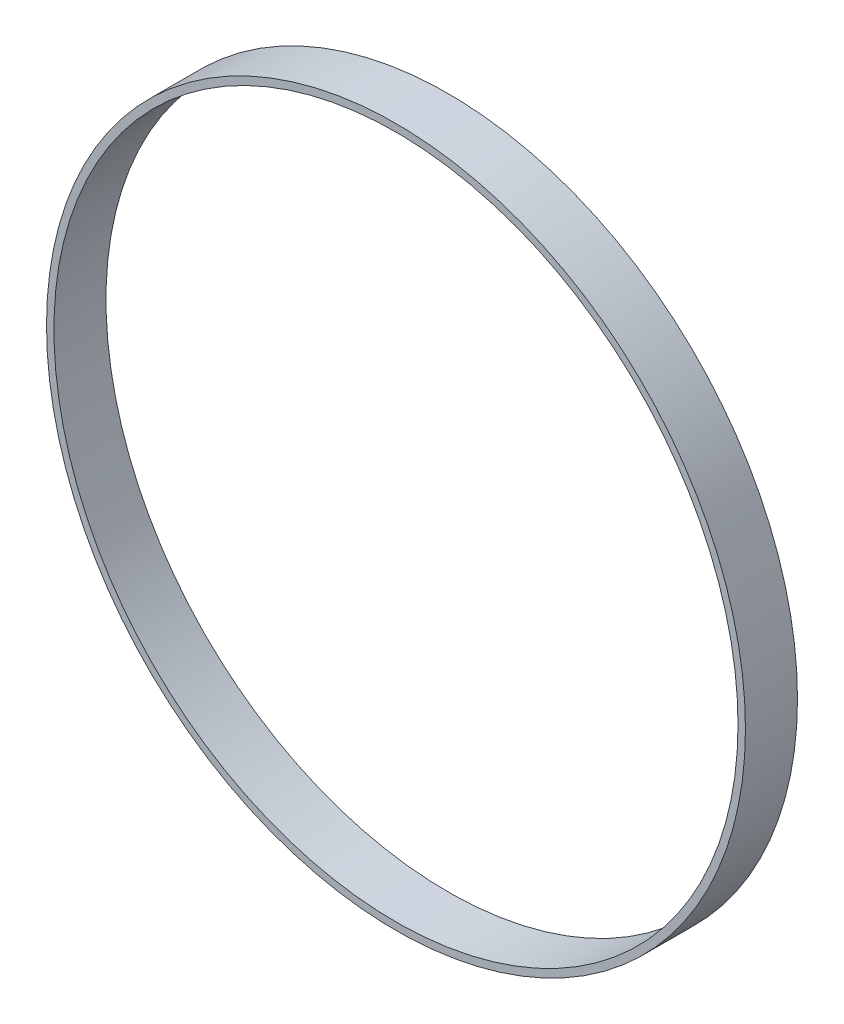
ISO-10303-21;
HEADER;
FILE_DESCRIPTION(('STEP AP214'),'2;1');
FILE_NAME('part.step','',(''),(''),'','','');
FILE_SCHEMA(('AUTOMOTIVE_DESIGN { 1 0 10303 214 1 1 1 1 }'));
ENDSEC;
DATA;
#1=APPLICATION_CONTEXT('core data for automotive mechanical design processes');
#2=APPLICATION_PROTOCOL_DEFINITION('international standard','automotive_design',2000,#1);
#3=PRODUCT_CONTEXT('',#1,'mechanical');
#4=PRODUCT('Part','Part','',(#3));
#5=PRODUCT_RELATED_PRODUCT_CATEGORY('part','',(#4));
#6=PRODUCT_DEFINITION_FORMATION('','',#4);
#7=PRODUCT_DEFINITION_CONTEXT('part definition',#1,'design');
#8=PRODUCT_DEFINITION('design','',#6,#7);
#9=PRODUCT_DEFINITION_SHAPE('','',#8);
#10=(LENGTH_UNIT() NAMED_UNIT(*) SI_UNIT(.MILLI.,.METRE.));
#11=(NAMED_UNIT(*) PLANE_ANGLE_UNIT() SI_UNIT($,.RADIAN.));
#12=(NAMED_UNIT(*) SI_UNIT($,.STERADIAN.) SOLID_ANGLE_UNIT());
#13=UNCERTAINTY_MEASURE_WITH_UNIT(LENGTH_MEASURE(1.E-05),#10,'distance_accuracy_value','');
#14=(GEOMETRIC_REPRESENTATION_CONTEXT(3) GLOBAL_UNCERTAINTY_ASSIGNED_CONTEXT((#13)) GLOBAL_UNIT_ASSIGNED_CONTEXT((#10,
#11,#12)) REPRESENTATION_CONTEXT('',''));
#15=CARTESIAN_POINT('',(0.,0.,0.));
#16=DIRECTION('',(0.,0.,1.));
#17=DIRECTION('',(1.,0.,0.));
#18=AXIS2_PLACEMENT_3D('',#15,#16,#17);
#19=CARTESIAN_POINT('',(0.,0.,7.));
#20=DIRECTION('',(0.,0.,1.));
#21=DIRECTION('',(1.,0.,0.));
#22=AXIS2_PLACEMENT_3D('',#19,#20,#21);
#23=PLANE('',#22);
#24=CARTESIAN_POINT('',(0.,0.,7.));
#25=DIRECTION('',(0.,0.,1.));
#26=DIRECTION('',(1.,0.,0.));
#27=AXIS2_PLACEMENT_3D('',#24,#25,#26);
#28=CIRCLE('',#27,47.);
#29=CARTESIAN_POINT('',(47.,0.,7.));
#30=VERTEX_POINT('',#29);
#31=EDGE_CURVE('E10',#30,#30,#28,.T.);
#32=ORIENTED_EDGE('',*,*,#31,.T.);
#33=EDGE_LOOP('',(#32));
#34=FACE_BOUND('',#33,.T.);
#35=CARTESIAN_POINT('',(0.,0.,7.));
#36=DIRECTION('',(0.,0.,1.));
#37=DIRECTION('',(1.,0.,0.));
#38=AXIS2_PLACEMENT_3D('',#35,#36,#37);
#39=CIRCLE('',#38,46.);
#40=CARTESIAN_POINT('',(46.,0.,7.));
#41=VERTEX_POINT('',#40);
#42=EDGE_CURVE('E42',#41,#41,#39,.T.);
#43=ORIENTED_EDGE('',*,*,#42,.F.);
#44=EDGE_LOOP('',(#43));
#45=FACE_BOUND('',#44,.T.);
#46=ADVANCED_FACE('F31',(#34,#45),#23,.T.);
#47=CARTESIAN_POINT('',(0.,0.,0.));
#48=DIRECTION('',(0.,0.,1.));
#49=DIRECTION('',(1.,0.,0.));
#50=AXIS2_PLACEMENT_3D('',#47,#48,#49);
#51=PLANE('',#50);
#52=CARTESIAN_POINT('',(0.,0.,0.));
#53=DIRECTION('',(0.,0.,1.));
#54=DIRECTION('',(1.,0.,0.));
#55=AXIS2_PLACEMENT_3D('',#52,#53,#54);
#56=CIRCLE('',#55,47.);
#57=CARTESIAN_POINT('',(47.,0.,0.));
#58=VERTEX_POINT('',#57);
#59=EDGE_CURVE('E35',#58,#58,#56,.T.);
#60=ORIENTED_EDGE('',*,*,#59,.F.);
#61=EDGE_LOOP('',(#60));
#62=FACE_BOUND('',#61,.T.);
#63=CARTESIAN_POINT('',(0.,0.,0.));
#64=DIRECTION('',(0.,0.,1.));
#65=DIRECTION('',(1.,0.,0.));
#66=AXIS2_PLACEMENT_3D('',#63,#64,#65);
#67=CIRCLE('',#66,46.);
#68=CARTESIAN_POINT('',(46.,0.,0.));
#69=VERTEX_POINT('',#68);
#70=EDGE_CURVE('E44',#69,#69,#67,.T.);
#71=ORIENTED_EDGE('',*,*,#70,.T.);
#72=EDGE_LOOP('',(#71));
#73=FACE_BOUND('',#72,.T.);
#74=ADVANCED_FACE('F54',(#62,#73),#51,.F.);
#75=CARTESIAN_POINT('',(0.,0.,7.));
#76=DIRECTION('',(0.,0.,-1.));
#77=DIRECTION('',(-1.,0.,0.));
#78=AXIS2_PLACEMENT_3D('',#75,#76,#77);
#79=CYLINDRICAL_SURFACE('',#78,47.);
#80=ORIENTED_EDGE('',*,*,#31,.F.);
#81=EDGE_LOOP('',(#80));
#82=FACE_BOUND('',#81,.T.);
#83=ORIENTED_EDGE('',*,*,#59,.T.);
#84=EDGE_LOOP('',(#83));
#85=FACE_BOUND('',#84,.T.);
#86=ADVANCED_FACE('F33',(#82,#85),#79,.T.);
#87=CARTESIAN_POINT('',(0.,0.,7.));
#88=DIRECTION('',(0.,0.,-1.));
#89=DIRECTION('',(-1.,0.,0.));
#90=AXIS2_PLACEMENT_3D('',#87,#88,#89);
#91=CYLINDRICAL_SURFACE('',#90,46.);
#92=ORIENTED_EDGE('',*,*,#42,.T.);
#93=EDGE_LOOP('',(#92));
#94=FACE_BOUND('',#93,.T.);
#95=ORIENTED_EDGE('',*,*,#70,.F.);
#96=EDGE_LOOP('',(#95));
#97=FACE_BOUND('',#96,.T.);
#98=ADVANCED_FACE('F50',(#94,#97),#91,.F.);
#99=CLOSED_SHELL('',(#46,#74,#86,#98));
#100=MANIFOLD_SOLID_BREP('B2',#99);
#101=ADVANCED_BREP_SHAPE_REPRESENTATION('',(#18,#100),#14);
#102=SHAPE_DEFINITION_REPRESENTATION(#9,#101);
ENDSEC;
END-ISO-10303-21;
